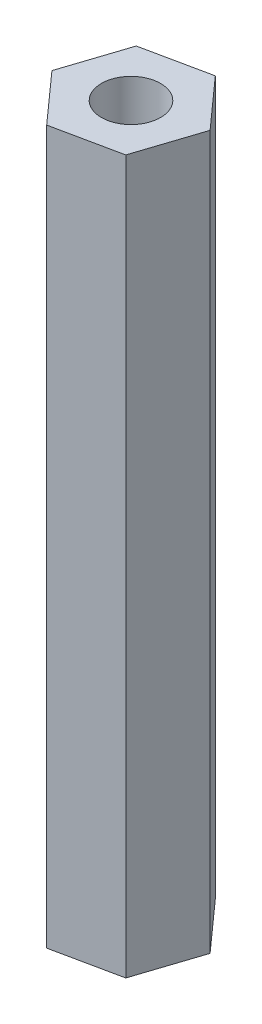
from build123d import *

# Parameters (mm, degrees)
SKETCH2_R           = 1.66
BOSS_EXTRUDE1_DEPTH = 40


with BuildPart() as part:
    # Sketch2 → Boss-Extrude1 (new body)
    with BuildSketch(Plane(origin=(0, 0, 0), x_dir=(1, 0, 0), z_dir=(0, 1, 0))):
        Polygon((-1.169551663, -3.561992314), (2.5, -2.793857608), (3.669551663, 0.768134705), (1.169551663, 3.561992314), (-2.5, 2.793857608), (-3.669551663, -0.768134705), align=None)
        with Locations(Location((0, 0, 0), (0, 0, 270))):
            Circle(SKETCH2_R, mode=Mode.SUBTRACT)
    extrude(amount=BOSS_EXTRUDE1_DEPTH)


solid = part.part
